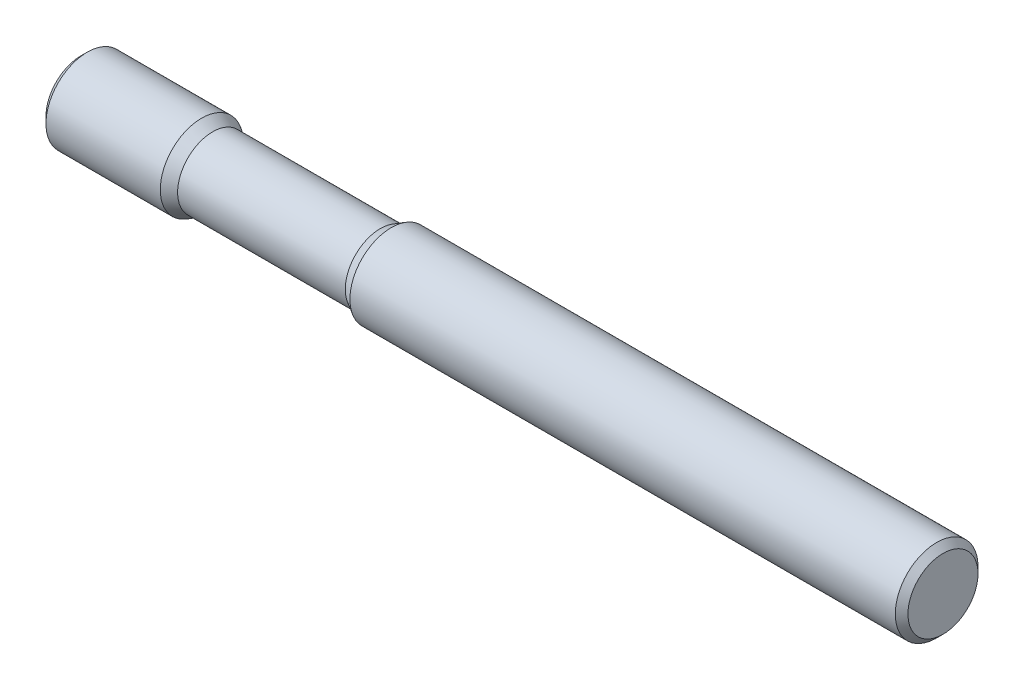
from build123d import *


with BuildPart() as part:
    # Esquisse1 → R_volution1 (revolve)
    with BuildSketch(Plane.XY, mode=Mode.PRIVATE) as r_volution1_sk:
        Polygon((0, 0), (0, 10.159695), (1.840305, 12), (35, 12), (38.187501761, 10.159695), (86.812498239, 10.159695), (90, 12), (248.159695, 12), (250, 10.159695), (250, 0), align=None)
    revolve(r_volution1_sk.sketch.rotate(Axis((250, 0, 0), (-1, 0, 0)), 90), axis=Axis((250, 0, 0), (-1, 0, 0)))


solid = part.part
